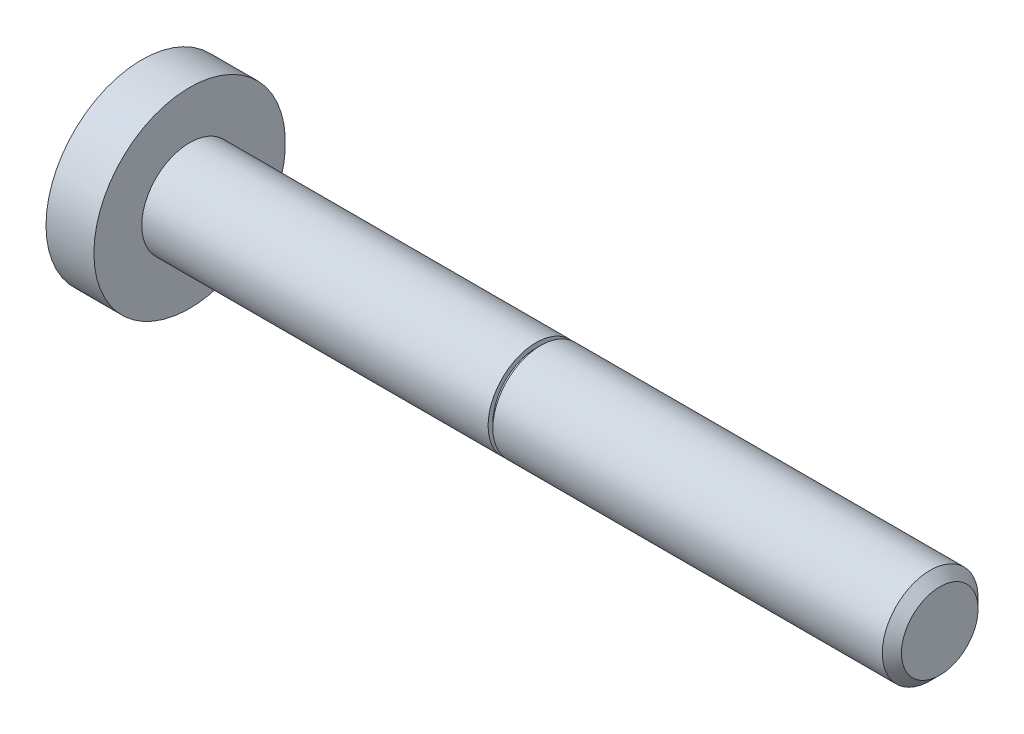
ISO-10303-21;
HEADER;
FILE_DESCRIPTION(('STEP AP214'),'2;1');
FILE_NAME('part.step','',(''),(''),'','','');
FILE_SCHEMA(('AUTOMOTIVE_DESIGN { 1 0 10303 214 1 1 1 1 }'));
ENDSEC;
DATA;
#1=APPLICATION_CONTEXT('core data for automotive mechanical design processes');
#2=APPLICATION_PROTOCOL_DEFINITION('international standard','automotive_design',2000,#1);
#3=PRODUCT_CONTEXT('',#1,'mechanical');
#4=PRODUCT('Part','Part','',(#3));
#5=PRODUCT_RELATED_PRODUCT_CATEGORY('part','',(#4));
#6=PRODUCT_DEFINITION_FORMATION('','',#4);
#7=PRODUCT_DEFINITION_CONTEXT('part definition',#1,'design');
#8=PRODUCT_DEFINITION('design','',#6,#7);
#9=PRODUCT_DEFINITION_SHAPE('','',#8);
#10=(LENGTH_UNIT() NAMED_UNIT(*) SI_UNIT(.MILLI.,.METRE.));
#11=(NAMED_UNIT(*) PLANE_ANGLE_UNIT() SI_UNIT($,.RADIAN.));
#12=(NAMED_UNIT(*) SI_UNIT($,.STERADIAN.) SOLID_ANGLE_UNIT());
#13=UNCERTAINTY_MEASURE_WITH_UNIT(LENGTH_MEASURE(1.E-05),#10,'distance_accuracy_value','');
#14=(GEOMETRIC_REPRESENTATION_CONTEXT(3) GLOBAL_UNCERTAINTY_ASSIGNED_CONTEXT((#13)) GLOBAL_UNIT_ASSIGNED_CONTEXT((#10,
#11,#12)) REPRESENTATION_CONTEXT('',''));
#15=CARTESIAN_POINT('',(0.,0.,0.));
#16=DIRECTION('',(0.,0.,1.));
#17=DIRECTION('',(1.,0.,0.));
#18=AXIS2_PLACEMENT_3D('',#15,#16,#17);
#19=CARTESIAN_POINT('',(-41.0184216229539,0.,-10.5));
#20=DIRECTION('',(1.,0.,0.));
#21=DIRECTION('',(0.,0.,-1.));
#22=AXIS2_PLACEMENT_3D('',#19,#20,#21);
#23=PLANE('',#22);
#24=CARTESIAN_POINT('',(-41.0184216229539,0.,0.));
#25=DIRECTION('',(-1.,0.,0.));
#26=DIRECTION('',(0.,0.,1.));
#27=AXIS2_PLACEMENT_3D('',#24,#25,#26);
#28=CIRCLE('',#27,10.5);
#29=CARTESIAN_POINT('',(-41.0184216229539,0.,10.5));
#30=VERTEX_POINT('',#29);
#31=EDGE_CURVE('E34',#30,#30,#28,.T.);
#32=ORIENTED_EDGE('',*,*,#31,.T.);
#33=EDGE_LOOP('',(#32));
#34=FACE_BOUND('',#33,.T.);
#35=ADVANCED_FACE('F24',(#34),#23,.F.);
#36=CARTESIAN_POINT('',(2.73157837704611,0.,0.));
#37=DIRECTION('',(-1.,0.,0.));
#38=DIRECTION('',(0.,0.,1.));
#39=AXIS2_PLACEMENT_3D('',#36,#37,#38);
#40=CYLINDRICAL_SURFACE('',#39,10.5);
#41=ORIENTED_EDGE('',*,*,#31,.F.);
#42=EDGE_LOOP('',(#41));
#43=FACE_BOUND('',#42,.T.);
#44=CARTESIAN_POINT('',(-35.7684216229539,0.,0.));
#45=DIRECTION('',(-1.,0.,0.));
#46=DIRECTION('',(0.,0.,1.));
#47=AXIS2_PLACEMENT_3D('',#44,#45,#46);
#48=CIRCLE('',#47,10.5);
#49=CARTESIAN_POINT('',(-35.7684216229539,0.,10.5));
#50=VERTEX_POINT('',#49);
#51=EDGE_CURVE('E38',#50,#50,#48,.T.);
#52=ORIENTED_EDGE('',*,*,#51,.T.);
#53=EDGE_LOOP('',(#52));
#54=FACE_BOUND('',#53,.T.);
#55=ADVANCED_FACE('F75',(#43,#54),#40,.T.);
#56=CARTESIAN_POINT('',(-35.7684216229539,0.,-5.24999999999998));
#57=DIRECTION('',(-1.,0.,0.));
#58=DIRECTION('',(0.,0.,1.));
#59=AXIS2_PLACEMENT_3D('',#56,#57,#58);
#60=PLANE('',#59);
#61=ORIENTED_EDGE('',*,*,#51,.F.);
#62=EDGE_LOOP('',(#61));
#63=FACE_BOUND('',#62,.T.);
#64=CARTESIAN_POINT('',(-35.7684216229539,0.,0.));
#65=DIRECTION('',(-1.,0.,0.));
#66=DIRECTION('',(0.,0.,1.));
#67=AXIS2_PLACEMENT_3D('',#64,#65,#66);
#68=CIRCLE('',#67,5.24999999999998);
#69=CARTESIAN_POINT('',(-35.7684216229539,0.,5.24999999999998));
#70=VERTEX_POINT('',#69);
#71=EDGE_CURVE('E43',#70,#70,#68,.T.);
#72=ORIENTED_EDGE('',*,*,#71,.T.);
#73=EDGE_LOOP('',(#72));
#74=FACE_BOUND('',#73,.T.);
#75=ADVANCED_FACE('F80',(#63,#74),#60,.F.);
#76=CARTESIAN_POINT('',(2.73157837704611,0.,0.));
#77=DIRECTION('',(-1.,0.,0.));
#78=DIRECTION('',(0.,0.,1.));
#79=AXIS2_PLACEMENT_3D('',#76,#77,#78);
#80=CYLINDRICAL_SURFACE('',#79,5.24999999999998);
#81=ORIENTED_EDGE('',*,*,#71,.F.);
#82=EDGE_LOOP('',(#81));
#83=FACE_BOUND('',#82,.T.);
#84=CARTESIAN_POINT('',(2.20657837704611,0.,0.));
#85=DIRECTION('',(-1.,0.,0.));
#86=DIRECTION('',(0.,0.,1.));
#87=AXIS2_PLACEMENT_3D('',#84,#85,#86);
#88=CIRCLE('',#87,5.24999999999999);
#89=CARTESIAN_POINT('',(2.20657837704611,0.,5.24999999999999));
#90=VERTEX_POINT('',#89);
#91=EDGE_CURVE('E46',#90,#90,#88,.T.);
#92=ORIENTED_EDGE('',*,*,#91,.T.);
#93=EDGE_LOOP('',(#92));
#94=FACE_BOUND('',#93,.T.);
#95=ADVANCED_FACE('F88',(#83,#94),#80,.T.);
#96=CARTESIAN_POINT('',(2.20657837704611,0.,-4.72499999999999));
#97=DIRECTION('',(-1.,0.,0.));
#98=DIRECTION('',(0.,0.,1.));
#99=AXIS2_PLACEMENT_3D('',#96,#97,#98);
#100=PLANE('',#99);
#101=ORIENTED_EDGE('',*,*,#91,.F.);
#102=EDGE_LOOP('',(#101));
#103=FACE_BOUND('',#102,.T.);
#104=CARTESIAN_POINT('',(2.20657837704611,0.,0.));
#105=DIRECTION('',(-1.,0.,0.));
#106=DIRECTION('',(0.,0.,1.));
#107=AXIS2_PLACEMENT_3D('',#104,#105,#106);
#108=CIRCLE('',#107,4.72499999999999);
#109=CARTESIAN_POINT('',(2.20657837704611,0.,4.72499999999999));
#110=VERTEX_POINT('',#109);
#111=EDGE_CURVE('E49',#110,#110,#108,.T.);
#112=ORIENTED_EDGE('',*,*,#111,.T.);
#113=EDGE_LOOP('',(#112));
#114=FACE_BOUND('',#113,.T.);
#115=ADVANCED_FACE('F94',(#103,#114),#100,.F.);
#116=CARTESIAN_POINT('',(2.73157837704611,0.,0.));
#117=DIRECTION('',(-1.,0.,0.));
#118=DIRECTION('',(0.,0.,1.));
#119=AXIS2_PLACEMENT_3D('',#116,#117,#118);
#120=CYLINDRICAL_SURFACE('',#119,4.72499999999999);
#121=ORIENTED_EDGE('',*,*,#111,.F.);
#122=EDGE_LOOP('',(#121));
#123=FACE_BOUND('',#122,.T.);
#124=CARTESIAN_POINT('',(2.73157837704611,0.,0.));
#125=DIRECTION('',(-1.,0.,0.));
#126=DIRECTION('',(0.,0.,1.));
#127=AXIS2_PLACEMENT_3D('',#124,#125,#126);
#128=CIRCLE('',#127,4.72499999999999);
#129=CARTESIAN_POINT('',(2.73157837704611,0.,4.72499999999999));
#130=VERTEX_POINT('',#129);
#131=EDGE_CURVE('E52',#130,#130,#128,.T.);
#132=ORIENTED_EDGE('',*,*,#131,.T.);
#133=EDGE_LOOP('',(#132));
#134=FACE_BOUND('',#133,.T.);
#135=ADVANCED_FACE('F71',(#123,#134),#120,.T.);
#136=CARTESIAN_POINT('',(2.73157837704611,0.,-5.24999999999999));
#137=DIRECTION('',(1.,0.,0.));
#138=DIRECTION('',(0.,0.,-1.));
#139=AXIS2_PLACEMENT_3D('',#136,#137,#138);
#140=PLANE('',#139);
#141=ORIENTED_EDGE('',*,*,#131,.F.);
#142=EDGE_LOOP('',(#141));
#143=FACE_BOUND('',#142,.T.);
#144=CARTESIAN_POINT('',(2.73157837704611,0.,0.));
#145=DIRECTION('',(-1.,0.,0.));
#146=DIRECTION('',(0.,0.,1.));
#147=AXIS2_PLACEMENT_3D('',#144,#145,#146);
#148=CIRCLE('',#147,5.24999999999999);
#149=CARTESIAN_POINT('',(2.73157837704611,0.,5.24999999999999));
#150=VERTEX_POINT('',#149);
#151=EDGE_CURVE('E55',#150,#150,#148,.T.);
#152=ORIENTED_EDGE('',*,*,#151,.T.);
#153=EDGE_LOOP('',(#152));
#154=FACE_BOUND('',#153,.T.);
#155=ADVANCED_FACE('F59',(#143,#154),#140,.F.);
#156=CARTESIAN_POINT('',(2.73157837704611,0.,0.));
#157=DIRECTION('',(-1.,0.,0.));
#158=DIRECTION('',(0.,0.,1.));
#159=AXIS2_PLACEMENT_3D('',#156,#157,#158);
#160=CYLINDRICAL_SURFACE('',#159,5.25);
#161=CARTESIAN_POINT('',(45.4315783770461,0.,0.));
#162=DIRECTION('',(1.,0.,0.));
#163=DIRECTION('',(0.,0.,-1.));
#164=AXIS2_PLACEMENT_3D('',#161,#162,#163);
#165=CIRCLE('',#164,5.25);
#166=CARTESIAN_POINT('',(45.4315783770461,0.,5.25));
#167=VERTEX_POINT('',#166);
#168=EDGE_CURVE('E30',#167,#167,#165,.F.);
#169=ORIENTED_EDGE('',*,*,#168,.T.);
#170=EDGE_LOOP('',(#169));
#171=FACE_BOUND('',#170,.T.);
#172=ORIENTED_EDGE('',*,*,#151,.F.);
#173=EDGE_LOOP('',(#172));
#174=FACE_BOUND('',#173,.T.);
#175=ADVANCED_FACE('F61',(#171,#174),#160,.T.);
#176=CARTESIAN_POINT('',(46.4815783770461,0.,-5.25));
#177=DIRECTION('',(1.,0.,0.));
#178=DIRECTION('',(0.,0.,-1.));
#179=AXIS2_PLACEMENT_3D('',#176,#177,#178);
#180=PLANE('',#179);
#181=CARTESIAN_POINT('',(46.4815783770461,0.,0.));
#182=DIRECTION('',(1.,0.,0.));
#183=DIRECTION('',(0.,0.,-1.));
#184=AXIS2_PLACEMENT_3D('',#181,#182,#183);
#185=CIRCLE('',#184,4.19999999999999);
#186=CARTESIAN_POINT('',(46.4815783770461,0.,4.2));
#187=VERTEX_POINT('',#186);
#188=EDGE_CURVE('E10',#187,#187,#185,.T.);
#189=ORIENTED_EDGE('',*,*,#188,.T.);
#190=EDGE_LOOP('',(#189));
#191=FACE_BOUND('',#190,.T.);
#192=ADVANCED_FACE('F63',(#191),#180,.T.);
#193=CARTESIAN_POINT('',(45.4315783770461,0.,0.));
#194=DIRECTION('',(-1.,0.,0.));
#195=DIRECTION('',(0.,0.,1.));
#196=AXIS2_PLACEMENT_3D('',#193,#194,#195);
#197=CONICAL_SURFACE('',#196,5.25,0.785398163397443);
#198=CARTESIAN_POINT('',(46.4815783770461,0.,4.2));
#199=CARTESIAN_POINT('',(46.4706408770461,0.,4.21093749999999));
#200=CARTESIAN_POINT('',(46.4597033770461,0.,4.221875));
#201=CARTESIAN_POINT('',(46.4378283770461,0.,4.24375));
#202=CARTESIAN_POINT('',(46.4268908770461,0.,4.2546875));
#203=CARTESIAN_POINT('',(46.4050158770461,0.,4.2765625));
#204=CARTESIAN_POINT('',(46.3940783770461,0.,4.2875));
#205=CARTESIAN_POINT('',(46.3722033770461,0.,4.309375));
#206=CARTESIAN_POINT('',(46.3612658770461,0.,4.3203125));
#207=CARTESIAN_POINT('',(46.3393908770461,0.,4.3421875));
#208=CARTESIAN_POINT('',(46.3284533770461,0.,4.353125));
#209=CARTESIAN_POINT('',(46.3065783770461,0.,4.375));
#210=CARTESIAN_POINT('',(46.2956408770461,0.,4.3859375));
#211=CARTESIAN_POINT('',(46.2737658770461,0.,4.4078125));
#212=CARTESIAN_POINT('',(46.2628283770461,0.,4.41875));
#213=CARTESIAN_POINT('',(46.2409533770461,0.,4.440625));
#214=CARTESIAN_POINT('',(46.2300158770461,0.,4.4515625));
#215=CARTESIAN_POINT('',(46.2081408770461,0.,4.4734375));
#216=CARTESIAN_POINT('',(46.1972033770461,0.,4.484375));
#217=CARTESIAN_POINT('',(46.1753283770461,0.,4.50625));
#218=CARTESIAN_POINT('',(46.1643908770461,0.,4.5171875));
#219=CARTESIAN_POINT('',(46.1425158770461,0.,4.5390625));
#220=CARTESIAN_POINT('',(46.1315783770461,0.,4.55));
#221=CARTESIAN_POINT('',(46.1097033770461,0.,4.571875));
#222=CARTESIAN_POINT('',(46.0987658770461,0.,4.5828125));
#223=CARTESIAN_POINT('',(46.0768908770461,0.,4.6046875));
#224=CARTESIAN_POINT('',(46.0659533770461,0.,4.615625));
#225=CARTESIAN_POINT('',(46.0440783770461,0.,4.6375));
#226=CARTESIAN_POINT('',(46.0331408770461,0.,4.6484375));
#227=CARTESIAN_POINT('',(46.0112658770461,0.,4.6703125));
#228=CARTESIAN_POINT('',(46.0003283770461,0.,4.68125));
#229=CARTESIAN_POINT('',(45.9784533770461,0.,4.703125));
#230=CARTESIAN_POINT('',(45.9675158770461,0.,4.7140625));
#231=CARTESIAN_POINT('',(45.9456408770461,0.,4.7359375));
#232=CARTESIAN_POINT('',(45.9347033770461,0.,4.746875));
#233=CARTESIAN_POINT('',(45.9128283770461,0.,4.76875));
#234=CARTESIAN_POINT('',(45.9018908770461,0.,4.7796875));
#235=CARTESIAN_POINT('',(45.8800158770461,0.,4.8015625));
#236=CARTESIAN_POINT('',(45.8690783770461,0.,4.8125));
#237=CARTESIAN_POINT('',(45.8472033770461,0.,4.834375));
#238=CARTESIAN_POINT('',(45.8362658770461,0.,4.8453125));
#239=CARTESIAN_POINT('',(45.8143908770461,0.,4.8671875));
#240=CARTESIAN_POINT('',(45.8034533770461,0.,4.878125));
#241=CARTESIAN_POINT('',(45.7815783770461,0.,4.9));
#242=CARTESIAN_POINT('',(45.7706408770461,0.,4.9109375));
#243=CARTESIAN_POINT('',(45.7487658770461,0.,4.9328125));
#244=CARTESIAN_POINT('',(45.7378283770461,0.,4.94375));
#245=CARTESIAN_POINT('',(45.7159533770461,0.,4.965625));
#246=CARTESIAN_POINT('',(45.7050158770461,0.,4.9765625));
#247=CARTESIAN_POINT('',(45.6831408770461,0.,4.9984375));
#248=CARTESIAN_POINT('',(45.6722033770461,0.,5.009375));
#249=CARTESIAN_POINT('',(45.6503283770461,0.,5.03125));
#250=CARTESIAN_POINT('',(45.6393908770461,0.,5.0421875));
#251=CARTESIAN_POINT('',(45.6175158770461,0.,5.0640625));
#252=CARTESIAN_POINT('',(45.6065783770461,0.,5.075));
#253=CARTESIAN_POINT('',(45.5847033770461,0.,5.096875));
#254=CARTESIAN_POINT('',(45.5737658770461,0.,5.1078125));
#255=CARTESIAN_POINT('',(45.5518908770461,0.,5.1296875));
#256=CARTESIAN_POINT('',(45.5409533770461,0.,5.140625));
#257=CARTESIAN_POINT('',(45.5190783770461,0.,5.1625));
#258=CARTESIAN_POINT('',(45.5081408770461,0.,5.1734375));
#259=CARTESIAN_POINT('',(45.4862658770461,0.,5.1953125));
#260=CARTESIAN_POINT('',(45.4753283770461,0.,5.20625));
#261=CARTESIAN_POINT('',(45.4534533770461,0.,5.228125));
#262=CARTESIAN_POINT('',(45.4425158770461,0.,5.2390625));
#263=CARTESIAN_POINT('',(45.4315783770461,0.,5.25));
#264=B_SPLINE_CURVE_WITH_KNOTS('',3,(#198,#199,#200,#201,#202,#203,#204,#205,#206,#207,#208,
#209,#210,#211,#212,#213,#214,#215,#216,#217,#218,#219,#220,#221,#222,#223,#224,#225,#226,#227,
#228,#229,#230,#231,#232,#233,#234,#235,#236,#237,#238,#239,#240,#241,#242,#243,#244,#245,#246,
#247,#248,#249,#250,#251,#252,#253,#254,#255,#256,#257,#258,#259,#260,#261,#262,#263),
.UNSPECIFIED.,.F.,.F.,(4,2,2,2,2,2,2,2,2,2,2,2,2,2,2,2,2,2,2,2,2,2,2,2,2,2,2,2,2,2,2,2,4),(0.,
0.0464038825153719,0.0928077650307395,0.139211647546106,0.185615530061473,0.232019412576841,
0.278423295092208,0.324827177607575,0.371231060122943,0.41763494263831,0.464038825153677,
0.510442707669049,0.556846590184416,0.603250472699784,0.649654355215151,0.696058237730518,
0.742462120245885,0.788866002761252,0.83526988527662,0.881673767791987,0.928077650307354,
0.974481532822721,1.02088541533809,1.06728929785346,1.11369318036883,1.16009706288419,
1.20650094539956,1.25290482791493,1.2993087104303,1.34571259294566,1.39211647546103,
1.4385203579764,1.48492424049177),.UNSPECIFIED.);
#265=EDGE_CURVE('BSEAM69',#187,#167,#264,.T.);
#266=ORIENTED_EDGE('',*,*,#188,.F.);
#267=ORIENTED_EDGE('',*,*,#168,.F.);
#268=ORIENTED_EDGE('',*,*,#265,.T.);
#269=ORIENTED_EDGE('',*,*,#265,.F.);
#270=EDGE_LOOP('',(#266,#268,#267,#269));
#271=FACE_BOUND('',#270,.T.);
#272=ADVANCED_FACE('F69',(#271),#197,.T.);
#273=CLOSED_SHELL('',(#35,#55,#75,#95,#115,#135,#155,#175,#192,#272));
#274=MANIFOLD_SOLID_BREP('B2',#273);
#275=ADVANCED_BREP_SHAPE_REPRESENTATION('',(#18,#274),#14);
#276=SHAPE_DEFINITION_REPRESENTATION(#9,#275);
ENDSEC;
END-ISO-10303-21;
